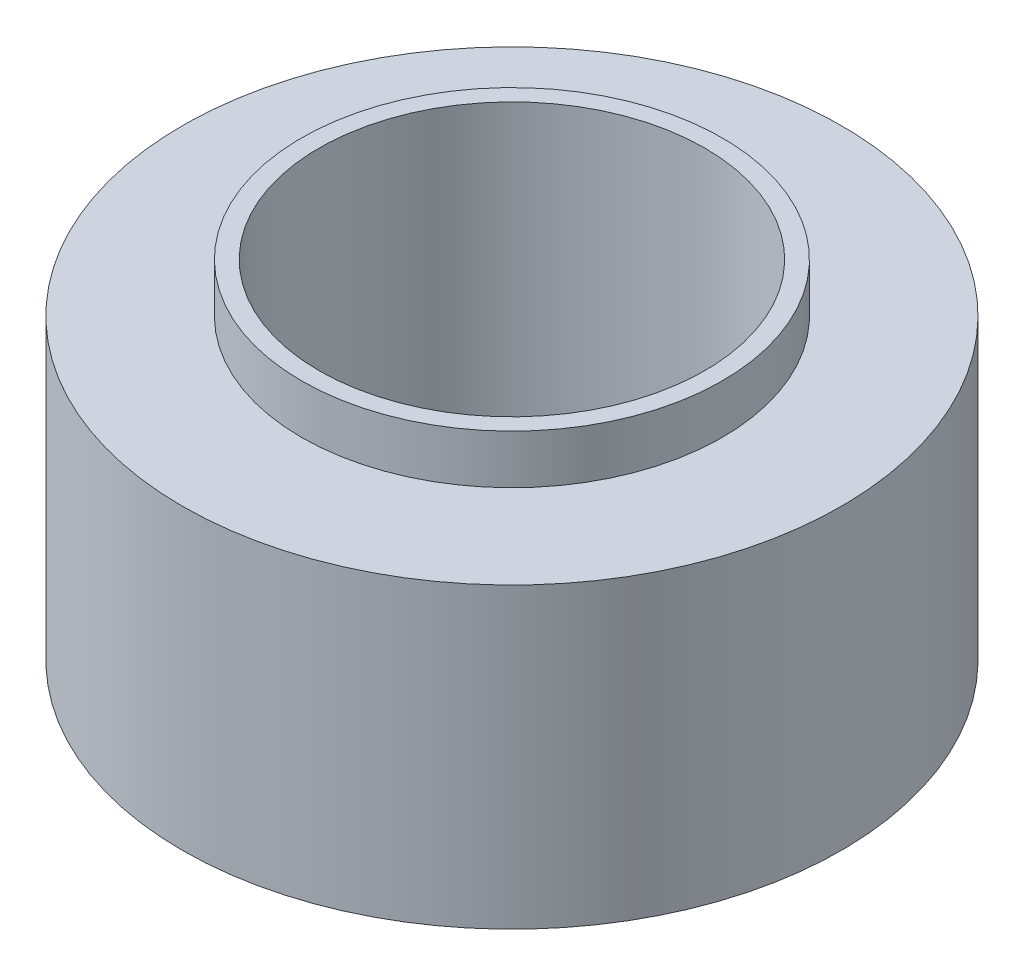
from build123d import *

# Parameters (mm, degrees)
SKETCH1_R           = 9.398
SKETCH1_R_2         = 5.5
BOSS_EXTRUDE1_DEPTH = 8.5
SKETCH2_R           = 6
SKETCH2_R_2         = 5.5
BOSS_EXTRUDE2_DEPTH = 1.397


with BuildPart() as part:
    # Sketch1 → Boss-Extrude1 (new body)
    with BuildSketch(Plane(origin=(0, 0, 0), x_dir=(1, 0, 0), z_dir=(0, 1, 0))):
        with Locations(Location((0, 0, 0), (0, 0, 270))):
            Circle(SKETCH1_R)
        with Locations(Location((0, 0, 0), (0, 0, 270))):
            Circle(SKETCH1_R_2, mode=Mode.SUBTRACT)
    extrude(amount=BOSS_EXTRUDE1_DEPTH)

    # Sketch2 → Boss-Extrude2 (add)
    with BuildSketch(Plane(origin=(0, 8.5, 0), x_dir=(1, 0, 0), z_dir=(0, 1, 0))):
        with Locations(Location((0, 0, 0), (0, 0, 270))):
            Circle(SKETCH2_R)
        with Locations(Location((0, 0, 0), (0, 0, 270))):
            Circle(SKETCH2_R_2, mode=Mode.SUBTRACT)
    extrude(amount=BOSS_EXTRUDE2_DEPTH)


solid = part.part
